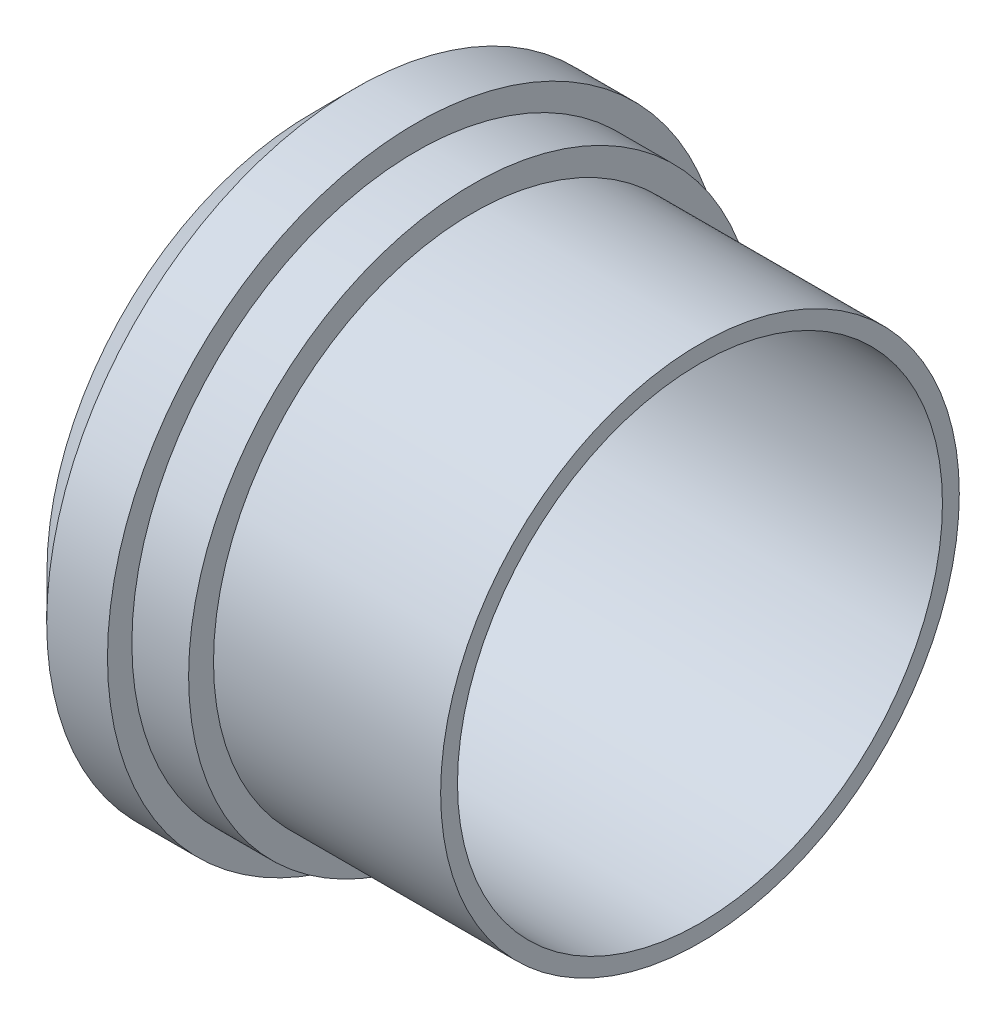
from build123d import *

# Parameters (mm, degrees)
SKETCH4_R          = 23.749
CUT_EXTRUDE1_DEPTH = 38.1


with BuildPart() as part:
    # Sketch1 → Revolve1 (revolve)
    with BuildSketch(Plane.XY, mode=Mode.PRIVATE) as revolve1_sk:
        Polygon((0, 0), (-22.24532, 0), (-22.24532, -2.4384), (-27.80284, -2.4384), (-27.80284, -4.826), (-33.7566, -4.826), (-38.1, -0.4572), (-38.1, 25.4), (0, 25.4), align=None)
    revolve(revolve1_sk.sketch.rotate(Axis((-38.1, 25.4, 0), (1, 0, 0)), 270), axis=Axis((-38.1, 25.4, 0), (1, 0, 0)))

    # Sketch4 → Cut-Extrude1 (cut)
    with BuildSketch(Plane.ZY.offset(38.1)):
        with Locations((0, 25.4)):
            Circle(SKETCH4_R)
    extrude(amount=-CUT_EXTRUDE1_DEPTH, mode=Mode.SUBTRACT)


solid = part.part
